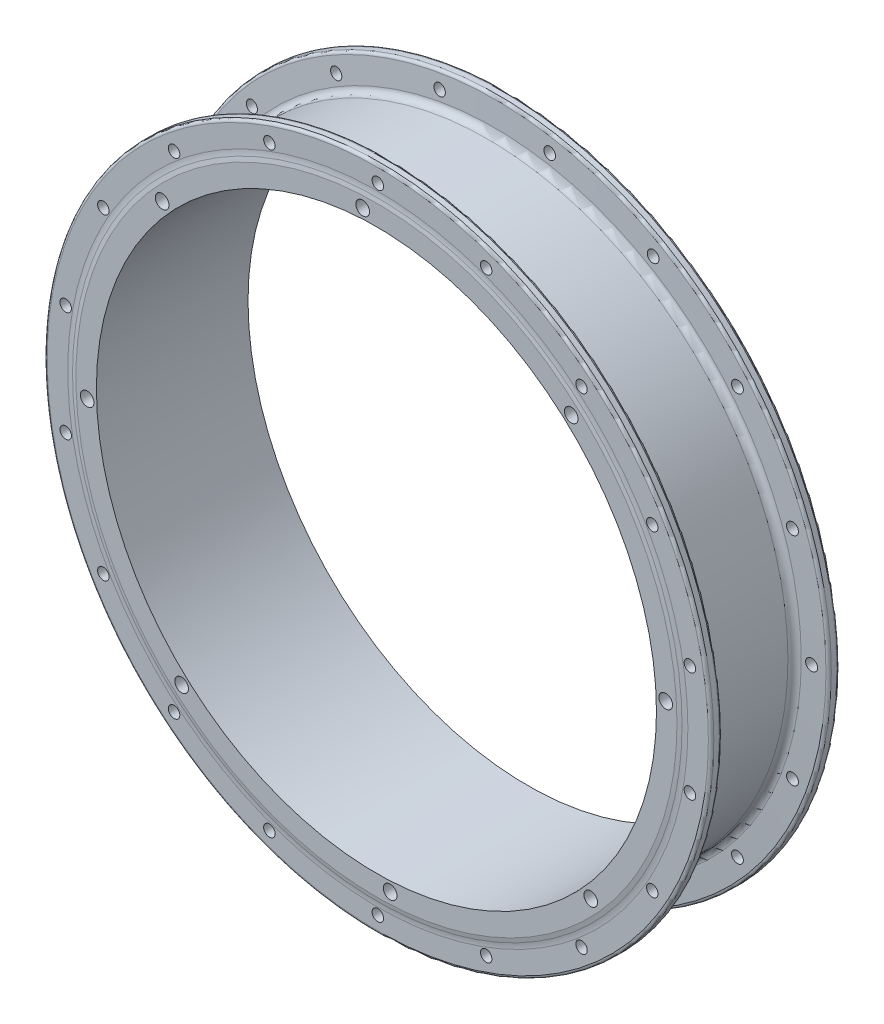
from build123d import *

# Parameters (mm, degrees)
SKETCH_2_R          = 2.1
CUT_EXTRUDE_1_DEPTH = 10
SKETCH_3_R          = 2.1
CUT_EXTRUDE_2_DEPTH = 20
SKETCH_4_R          = 2.5
CUT_EXTRUDE_4_DEPTH = 25
SKETCH_5_R          = 2.5
CUT_EXTRUDE_5_DEPTH = 25
SKETCH_6_R          = 102.5
CUT_EXTRUDE_6_DEPTH = 182.240861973


with BuildPart() as part:
    # Sketch 1 → Revolve 1 (revolve)
    with BuildSketch(Plane(origin=(0, 0, 0), x_dir=(1, 0, 0), z_dir=(0, 1, 0)), mode=Mode.PRIVATE) as revolve_1_sk:
        with BuildLine():
            Line((-110, 24), (-110, 6.889334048))
            ThreePointArc((-110, 6.889334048), (-110.692684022, 5.162021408), (-112.386887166, 4.391894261))
            Line((-112.386887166, 4.391894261), (-121.045245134, 3.999744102))
            ThreePointArc((-121.045245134, 3.999744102), (-121.722926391, 3.691693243), (-122, 3.000768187))
            Line((-122, 3.000768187), (-122, 1))
            ThreePointArc((-122, 1), (-121.707106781, 0.292893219), (-121, 0))
            Line((-121, 0), (-113.5, 0))
            ThreePointArc((-113.5, 0), (-112.520698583, -0.048067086), (-111.550811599, -0.191806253))
            Line((-111.550811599, -0.191806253), (-110, -0.5))
            Line((-110, -0.5), (0, -0.5))
            Line((0, -0.5), (0, 55))
            Line((0, 55), (-110, 55))
            Line((-110, 55), (-110, 50))
            ThreePointArc((-110, 50), (-110.878679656, 47.878679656), (-113, 47))
            Line((-113, 47), (-121, 47))
            ThreePointArc((-121, 47), (-121.707106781, 46.707106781), (-122, 46))
            Line((-122, 46), (-122, 43.999231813))
            ThreePointArc((-122, 43.999231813), (-121.722926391, 43.308306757), (-121.045245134, 43.000255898))
            Line((-121.045245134, 43.000255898), (-112.386887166, 42.608105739))
            ThreePointArc((-112.386887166, 42.608105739), (-110.692684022, 41.837978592), (-110, 40.110665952))
            Line((-110, 40.110665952), (-110, 24))
        make_face()
    revolve(revolve_1_sk.sketch.rotate(Axis((0, 0, 0), (0, 0, -1)), 180), axis=Axis((0, 0, 0), (0, 0, -1)))

    # Sketch 2 → Cut-Extrude 1 (cut)
    with BuildSketch(Plane.XY.offset(0.5)):
        with Locations(Location((0, 116, 0), (0, 0, 224.91233598))):
            Circle(SKETCH_2_R)
        with Locations(Location((39.674336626, 109.004344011, 0), (0, 0, 224.937167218))):
            Circle(SKETCH_2_R)
        with Locations(Location((74.563362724, 88.861155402, 0), (0, 0, 224.986060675))):
            Circle(SKETCH_2_R)
        with Locations(Location((100.458946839, 58, 0), (0, 0, 225.04041086))):
            Circle(SKETCH_2_R)
        with Locations(Location((114.237699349, 20.143188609, 0), (0, 0, 225.079053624))):
            Circle(SKETCH_2_R)
        with Locations(Location((114.237699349, -20.143188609, 0), (0, 0, 225.088147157))):
            Circle(SKETCH_2_R)
        with Locations(Location((100.458946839, -58, 0), (0, 0, 225.067214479))):
            Circle(SKETCH_2_R)
        with Locations(Location((74.563362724, -88.861155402, 0), (0, 0, 225.028525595))):
            Circle(SKETCH_2_R)
        with Locations(Location((39.674336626, -109.004344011, 0), (0, 0, 224.990624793))):
            Circle(SKETCH_2_R)
        with Locations(Location((0, -116, 0), (0, 0, 224.969693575))):
            Circle(SKETCH_2_R)
        with Locations(Location((-39.674336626, -109.004344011, 0), (0, 0, 224.972378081))):
            Circle(SKETCH_2_R)
        with Locations(Location((-74.563362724, -88.861155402, 0), (0, 0, 224.993424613))):
            Circle(SKETCH_2_R)
        with Locations(Location((-100.458946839, -58, 0), (0, 0, 225.018648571))):
            Circle(SKETCH_2_R)
        with Locations(Location((-114.237699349, -20.143188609, 0), (0, 0, 225.031856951))):
            Circle(SKETCH_2_R)
        with Locations(Location((-114.237699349, 20.143188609, 0), (0, 0, 225.022654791))):
            Circle(SKETCH_2_R)
        with Locations(Location((-100.458946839, 58, 0), (0, 0, 224.991695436))):
            Circle(SKETCH_2_R)
        with Locations(Location((-74.563362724, 88.861155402, 0), (0, 0, 224.951028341))):
            Circle(SKETCH_2_R)
        with Locations(Location((-39.674336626, 109.004344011, 0), (0, 0, 224.919087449))):
            Circle(SKETCH_2_R)
    extrude(amount=-CUT_EXTRUDE_1_DEPTH, mode=Mode.SUBTRACT)

    # Sketch 3 → Cut-Extrude 2 (cut)
    with BuildSketch(Plane(origin=(0, 0, -55), x_dir=(-1, 0, 0), z_dir=(0, 0, -1))):
        with Locations(Location((116, 0, 0), (0, 0, 314.969693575))):
            Circle(SKETCH_3_R)
        with Locations(Location((109.004344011, -39.674336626, 0), (0, 0, 314.972378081))):
            Circle(SKETCH_3_R)
        with Locations(Location((88.861155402, -74.563362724, 0), (0, 0, 314.993424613))):
            Circle(SKETCH_3_R)
        with Locations(Location((58, -100.458946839, 0), (0, 0, 315.018648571))):
            Circle(SKETCH_3_R)
        with Locations(Location((20.143188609, -114.237699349, 0), (0, 0, 315.031856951))):
            Circle(SKETCH_3_R)
        with Locations(Location((-20.143188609, -114.237699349, 0), (0, 0, 315.022654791))):
            Circle(SKETCH_3_R)
        with Locations(Location((-58, -100.458946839, 0), (0, 0, 314.991695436))):
            Circle(SKETCH_3_R)
        with Locations(Location((-88.861155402, -74.563362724, 0), (0, 0, 314.951028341))):
            Circle(SKETCH_3_R)
        with Locations(Location((-109.004344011, -39.674336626, 0), (0, 0, 314.919087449))):
            Circle(SKETCH_3_R)
        with Locations(Location((-116, 0, 0), (0, 0, 180.000000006))):
            Circle(SKETCH_3_R)
        with Locations(Location((-109.004344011, 39.674336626, 0), (0, 0, 314.937167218))):
            Circle(SKETCH_3_R)
        with Locations(Location((-88.861155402, 74.563362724, 0), (0, 0, 314.986060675))):
            Circle(SKETCH_3_R)
        with Locations(Location((-58, 100.458946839, 0), (0, 0, 315.04041086))):
            Circle(SKETCH_3_R)
        with Locations(Location((-20.143188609, 114.237699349, 0), (0, 0, 315.079053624))):
            Circle(SKETCH_3_R)
        with Locations(Location((20.143188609, 114.237699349, 0), (0, 0, 315.088147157))):
            Circle(SKETCH_3_R)
        with Locations(Location((58, 100.458946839, 0), (0, 0, 315.067214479))):
            Circle(SKETCH_3_R)
        with Locations(Location((88.861155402, 74.563362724, 0), (0, 0, 315.028525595))):
            Circle(SKETCH_3_R)
        with Locations(Location((109.004344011, 39.674336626, 0), (0, 0, 314.990624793))):
            Circle(SKETCH_3_R)
    extrude(amount=-CUT_EXTRUDE_2_DEPTH, mode=Mode.SUBTRACT)

    # Sketch 4 → Cut-Extrude 4 (cut)
    with BuildSketch(Plane.XY.offset(0.5)):
        with Locations((-5.031575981, 105.880513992)):
            Circle(SKETCH_4_R)
        with Locations((71.310967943, 78.426690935)):
            Circle(SKETCH_4_R)
        with Locations((105.880513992, 5.031575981)):
            Circle(SKETCH_4_R)
        with Locations((78.426690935, -71.310967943)):
            Circle(SKETCH_4_R)
        with Locations((5.031575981, -105.880513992)):
            Circle(SKETCH_4_R)
        with Locations((-71.310967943, -78.426690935)):
            Circle(SKETCH_4_R)
        with Locations((-105.880513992, -5.031575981)):
            Circle(SKETCH_4_R)
        with Locations((-78.426690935, 71.310967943)):
            Circle(SKETCH_4_R)
    extrude(amount=-CUT_EXTRUDE_4_DEPTH, mode=Mode.SUBTRACT)

    # Sketch 5 → Cut-Extrude 5 (cut)
    with BuildSketch(Plane(origin=(0, 0, -55), x_dir=(-1, 0, 0), z_dir=(0, 0, -1))):
        with Locations((-16.119277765, 104.767212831)):
            Circle(SKETCH_5_R)
        with Locations((62.683556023, 85.479657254)):
            Circle(SKETCH_5_R)
        with Locations((104.767212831, 16.119277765)):
            Circle(SKETCH_5_R)
        with Locations((85.479657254, -62.683556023)):
            Circle(SKETCH_5_R)
        with Locations((16.119277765, -104.767212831)):
            Circle(SKETCH_5_R)
        with Locations((-62.683556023, -85.479657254)):
            Circle(SKETCH_5_R)
        with Locations((-104.767212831, -16.119277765)):
            Circle(SKETCH_5_R)
        with Locations((-85.479657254, 62.683556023)):
            Circle(SKETCH_5_R)
    extrude(amount=-CUT_EXTRUDE_5_DEPTH, mode=Mode.SUBTRACT)

    # Sketch 6 → Cut-Extrude 6 (cut, through all)
    with BuildSketch(Plane(origin=(0, 0, -55), x_dir=(-1, 0, 0), z_dir=(0, 0, -1))):
        Circle(SKETCH_6_R)
    extrude(amount=-CUT_EXTRUDE_6_DEPTH, mode=Mode.SUBTRACT)


solid = part.part
